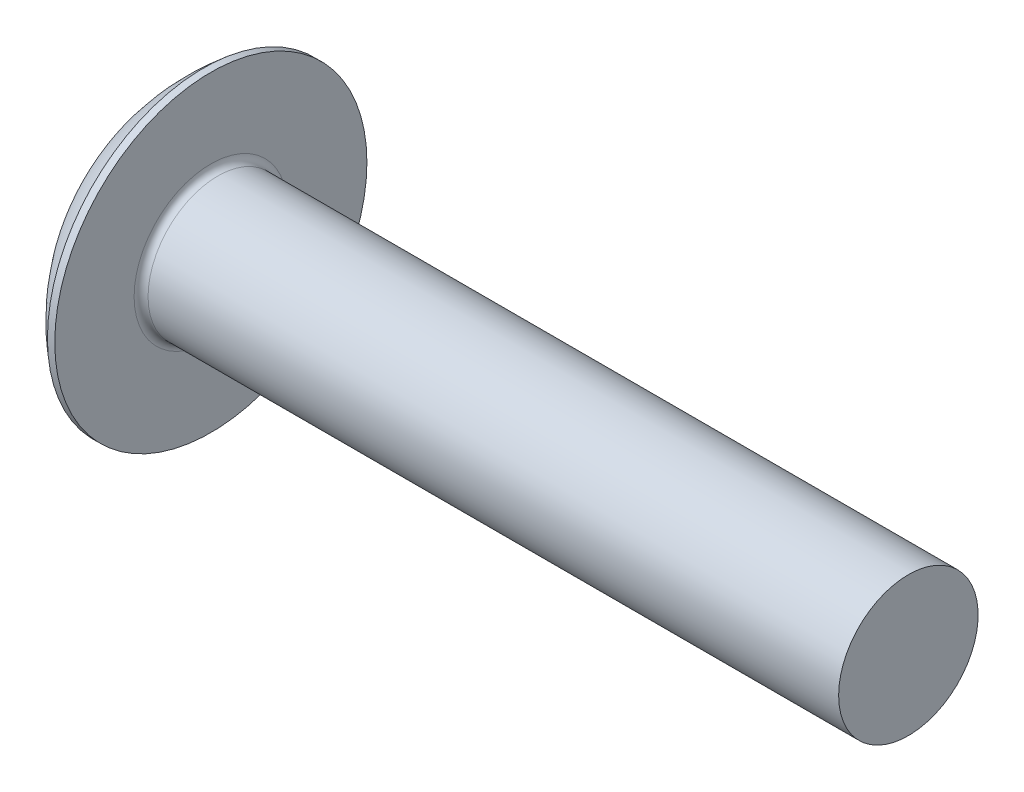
from build123d import *

# Parameters (mm, degrees)
FILLET1_R  = 0.4
SLOTSKE_W  = 17.9
SLOTSKE_H  = 2.31
SLOT_DEPTH = 2.17


with BuildPart() as part:
    # BodySke → BaseBody (revolve)
    with BuildSketch(Plane.XY, mode=Mode.PRIVATE) as basebody_sk:
        with BuildLine():
            Line((4.7, 8.95), (4.7, 4))
            Line((4.7, 4), (44.7, 4))
            Line((44.7, 4), (44.7, 0))
            Line((44.7, 0), (0, 0))
            ThreePointArc((0, 0), (1.124663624, 4.960080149), (4.278677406, 8.95))
            Line((4.278677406, 8.95), (4.7, 8.95))
        make_face()
    revolve(basebody_sk.sketch.rotate(Axis((0, 0, 0), (1, 0, 0)), 90), axis=Axis((0, 0, 0), (1, 0, 0)))

    # Fillet1
    fillet1_edges = [part.edges().sort_by_distance(p)[0] for p in [
        (4.7, 0, -4),
    ]]
    fillet(fillet1_edges, radius=FILLET1_R)

    # SlotSke → Slot (cut)
    with BuildSketch(Plane(origin=(0, 0, 0), x_dir=(0, 0, -1), z_dir=(1, 0, 0))):
        Rectangle(SLOTSKE_W, SLOTSKE_H)
    extrude(amount=SLOT_DEPTH, mode=Mode.SUBTRACT)


solid = part.part
